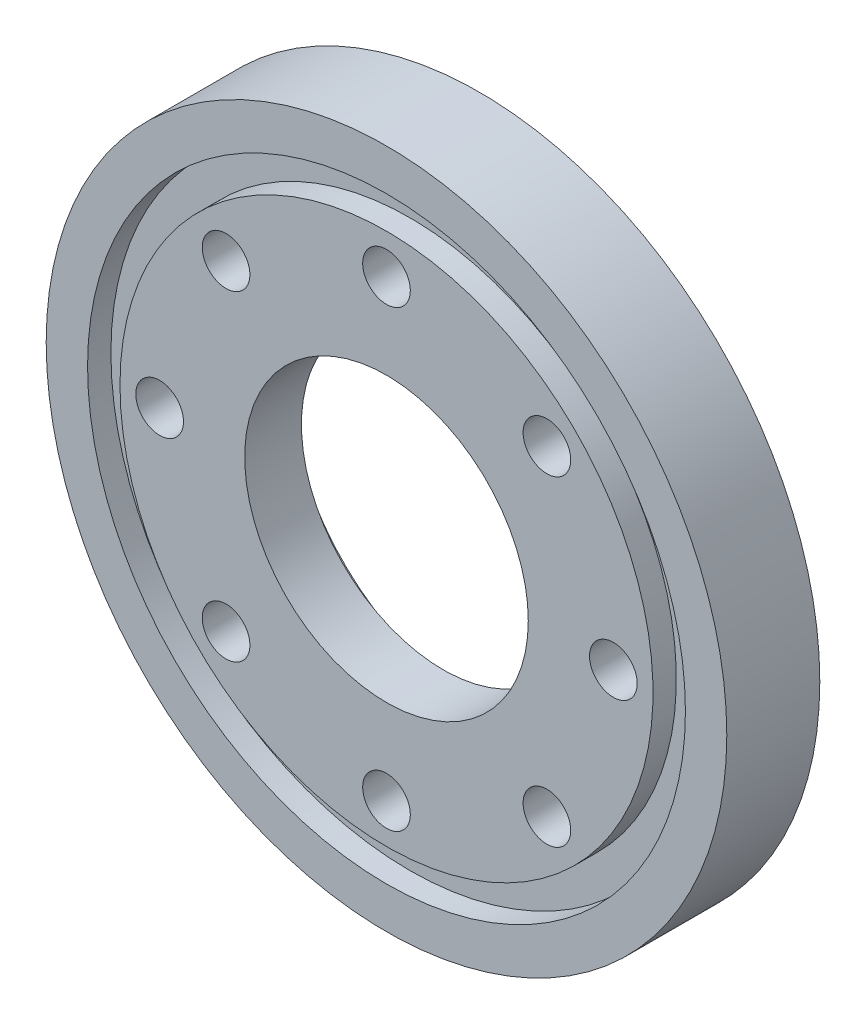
from build123d import *

# Parameters (mm, degrees)
SKETCH1_R           = 30
SKETCH1_R_2         = 12.5
BOSS_EXTRUDE1_DEPTH = 5
SKETCH3_R           = 26.3525
SKETCH3_R_2         = 23.495
CUT_EXTRUDE2_DEPTH  = 2.0574
SKETCH8_R           = 15.0375
SKETCH8_R_2         = 13.5375
CUT_EXTRUDE8_DEPTH  = 3.2
BOSS_EXTRUDE3_START = 3.2
SKETCH9_R           = 30
SKETCH9_R_2         = 15
BOSS_EXTRUDE3_DEPTH = 3.2
CIRPATTERN3_COUNT   = 8
SKETCH14_W          = 1.905
SKETCH14_H          = 3.175


with BuildPart() as part:
    # Sketch1 → Boss-Extrude1 (new body)
    with BuildSketch(Plane.XY):
        Circle(SKETCH1_R)
        Circle(SKETCH1_R_2, mode=Mode.SUBTRACT)
    extrude(amount=BOSS_EXTRUDE1_DEPTH)

    # Sketch3 → Cut-Extrude2 (cut)
    with BuildSketch(Plane(origin=(0, 0, 5), x_dir=(-1, 0, 0), z_dir=(0, 0, -1))):
        Circle(SKETCH3_R)
        Circle(SKETCH3_R_2, mode=Mode.SUBTRACT)
    extrude(amount=CUT_EXTRUDE2_DEPTH, mode=Mode.SUBTRACT)

    # Sketch4 → Revolve1 (revolve)
    with BuildSketch(Plane(origin=(0, 0, 0), x_dir=(1, 0, 0), z_dir=(0, 1, 0)), mode=Mode.PRIVATE) as revolve1_sk:
        Polygon((-12.6875, -1.8), (-13.5375, 0.6), (-13.5375, -2.6), (-15.0375, -2.6), (-15.0375, 0.6), (-15.8875, -1.8), (-15.8875, -5), (-12.6875, -5), align=None)
    revolve(revolve1_sk.sketch.rotate(Axis((0, 0, -11.985012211), (0, 0, 1)), 180), axis=Axis((0, 0, -11.985012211), (0, 0, 1)))

    # Sketch8 → Cut-Extrude8 (cut)
    with BuildSketch(Plane(origin=(0, 0, 0), x_dir=(-1, 0, 0), z_dir=(0, 0, -1))):
        Circle(SKETCH8_R)
        Circle(SKETCH8_R_2, mode=Mode.SUBTRACT)
    extrude(amount=-CUT_EXTRUDE8_DEPTH, mode=Mode.SUBTRACT)

    # Sketch9 → Boss-Extrude3 (add)
    with BuildSketch(Plane(origin=(0, 0, 0), x_dir=(-1, 0, 0), z_dir=(0, 0, -1)).offset(BOSS_EXTRUDE3_START)):
        Circle(SKETCH9_R)
        Circle(SKETCH9_R_2, mode=Mode.SUBTRACT)
    extrude(amount=-BOSS_EXTRUDE3_DEPTH)

    # Sketch12 → M5x0.8 Tapped Hole2 (revolve, cut)
    with BuildSketch(Plane(origin=(-20, 0, 5), x_dir=(0, -1, 0), z_dir=(1, 0, 0))):
        Polygon((0, 0), (0, 6.2618073), (2.1, 5), (2.1, 0), align=None)
    m5x0_8_tapped_hole2 = revolve(axis=Axis((-20, 0, 11.35), (0, 0, -1)), mode=Mode.SUBTRACT)

    # CirPattern3: M5x0.8 Tapped Hole2 ×8 about axis
    cirpattern3_axis = Axis((0, 0, 0), (0, 0, 1))
    for i in range(1, CIRPATTERN3_COUNT):
        add(m5x0_8_tapped_hole2.rotate(cirpattern3_axis, i * 360 / CIRPATTERN3_COUNT), mode=Mode.SUBTRACT)

    # Sketch14 → Cut-Revolve2 (revolve, cut)
    with BuildSketch(Plane(origin=(0, 0, 0), x_dir=(1, 0, 0), z_dir=(0, 1, 0)), mode=Mode.PRIVATE) as cut_revolve2_sk:
        with Locations((15.9385, 1.6125)):
            Rectangle(SKETCH14_W, SKETCH14_H)
    revolve(cut_revolve2_sk.sketch.rotate(Axis((0, 0, 5), (0, 0, -1)), 180), axis=Axis((0, 0, 5), (0, 0, -1)), mode=Mode.SUBTRACT)


solid = part.part
